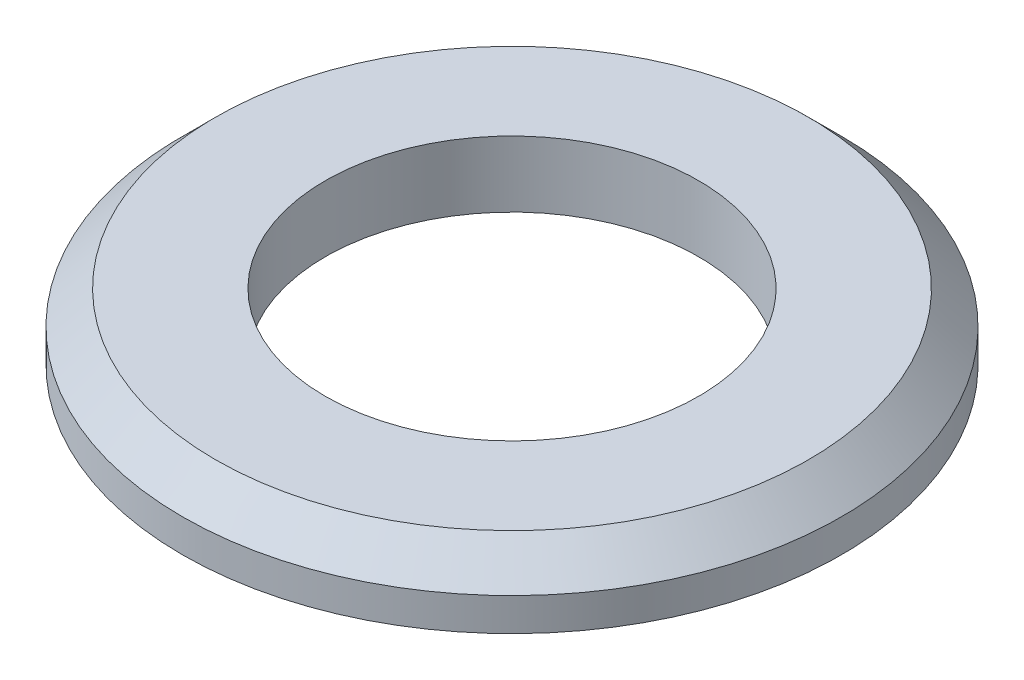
ISO-10303-21;
HEADER;
FILE_DESCRIPTION(('STEP AP214'),'2;1');
FILE_NAME('part.step','',(''),(''),'','','');
FILE_SCHEMA(('AUTOMOTIVE_DESIGN { 1 0 10303 214 1 1 1 1 }'));
ENDSEC;
DATA;
#1=APPLICATION_CONTEXT('core data for automotive mechanical design processes');
#2=APPLICATION_PROTOCOL_DEFINITION('international standard','automotive_design',2000,#1);
#3=PRODUCT_CONTEXT('',#1,'mechanical');
#4=PRODUCT('Part','Part','',(#3));
#5=PRODUCT_RELATED_PRODUCT_CATEGORY('part','',(#4));
#6=PRODUCT_DEFINITION_FORMATION('','',#4);
#7=PRODUCT_DEFINITION_CONTEXT('part definition',#1,'design');
#8=PRODUCT_DEFINITION('design','',#6,#7);
#9=PRODUCT_DEFINITION_SHAPE('','',#8);
#10=(LENGTH_UNIT() NAMED_UNIT(*) SI_UNIT(.MILLI.,.METRE.));
#11=(NAMED_UNIT(*) PLANE_ANGLE_UNIT() SI_UNIT($,.RADIAN.));
#12=(NAMED_UNIT(*) SI_UNIT($,.STERADIAN.) SOLID_ANGLE_UNIT());
#13=UNCERTAINTY_MEASURE_WITH_UNIT(LENGTH_MEASURE(1.E-05),#10,'distance_accuracy_value','');
#14=(GEOMETRIC_REPRESENTATION_CONTEXT(3) GLOBAL_UNCERTAINTY_ASSIGNED_CONTEXT((#13)) GLOBAL_UNIT_ASSIGNED_CONTEXT((#10,
#11,#12)) REPRESENTATION_CONTEXT('',''));
#15=CARTESIAN_POINT('',(0.,0.,0.));
#16=DIRECTION('',(0.,0.,1.));
#17=DIRECTION('',(1.,0.,0.));
#18=AXIS2_PLACEMENT_3D('',#15,#16,#17);
#19=CARTESIAN_POINT('',(0.,3.,0.));
#20=DIRECTION('',(0.,1.,0.));
#21=DIRECTION('',(0.,0.,1.));
#22=AXIS2_PLACEMENT_3D('',#19,#20,#21);
#23=PLANE('',#22);
#24=CARTESIAN_POINT('',(0.,3.,0.));
#25=DIRECTION('',(0.,1.,0.));
#26=DIRECTION('',(0.,0.,1.));
#27=AXIS2_PLACEMENT_3D('',#24,#25,#26);
#28=CIRCLE('',#27,13.5);
#29=CARTESIAN_POINT('',(0.,3.,13.5));
#30=VERTEX_POINT('',#29);
#31=EDGE_CURVE('E35',#30,#30,#28,.T.);
#32=ORIENTED_EDGE('',*,*,#31,.T.);
#33=EDGE_LOOP('',(#32));
#34=FACE_BOUND('',#33,.T.);
#35=CARTESIAN_POINT('',(0.,3.,0.));
#36=DIRECTION('',(0.,1.,0.));
#37=DIRECTION('',(0.,0.,1.));
#38=AXIS2_PLACEMENT_3D('',#35,#36,#37);
#39=CIRCLE('',#38,8.5);
#40=CARTESIAN_POINT('',(0.,3.,8.5));
#41=VERTEX_POINT('',#40);
#42=EDGE_CURVE('E43',#41,#41,#39,.T.);
#43=ORIENTED_EDGE('',*,*,#42,.F.);
#44=EDGE_LOOP('',(#43));
#45=FACE_BOUND('',#44,.T.);
#46=ADVANCED_FACE('F28',(#34,#45),#23,.T.);
#47=CARTESIAN_POINT('',(0.,0.,0.));
#48=DIRECTION('',(0.,1.,0.));
#49=DIRECTION('',(0.,0.,1.));
#50=AXIS2_PLACEMENT_3D('',#47,#48,#49);
#51=PLANE('',#50);
#52=CARTESIAN_POINT('',(0.,0.,0.));
#53=DIRECTION('',(0.,1.,0.));
#54=DIRECTION('',(0.,0.,1.));
#55=AXIS2_PLACEMENT_3D('',#52,#53,#54);
#56=CIRCLE('',#55,15.);
#57=CARTESIAN_POINT('',(0.,0.,15.));
#58=VERTEX_POINT('',#57);
#59=EDGE_CURVE('E39',#58,#58,#56,.T.);
#60=ORIENTED_EDGE('',*,*,#59,.F.);
#61=EDGE_LOOP('',(#60));
#62=FACE_BOUND('',#61,.T.);
#63=CARTESIAN_POINT('',(0.,0.,0.));
#64=DIRECTION('',(0.,1.,0.));
#65=DIRECTION('',(0.,0.,1.));
#66=AXIS2_PLACEMENT_3D('',#63,#64,#65);
#67=CIRCLE('',#66,8.5);
#68=CARTESIAN_POINT('',(0.,0.,8.5));
#69=VERTEX_POINT('',#68);
#70=EDGE_CURVE('E48',#69,#69,#67,.T.);
#71=ORIENTED_EDGE('',*,*,#70,.T.);
#72=EDGE_LOOP('',(#71));
#73=FACE_BOUND('',#72,.T.);
#74=ADVANCED_FACE('F52',(#62,#73),#51,.F.);
#75=CARTESIAN_POINT('',(0.,3.,0.));
#76=DIRECTION('',(0.,-1.,0.));
#77=DIRECTION('',(0.,0.,-1.));
#78=AXIS2_PLACEMENT_3D('',#75,#76,#77);
#79=CYLINDRICAL_SURFACE('',#78,15.);
#80=CARTESIAN_POINT('',(0.,1.5,0.));
#81=DIRECTION('',(0.,1.,0.));
#82=DIRECTION('',(0.,0.,1.));
#83=AXIS2_PLACEMENT_3D('',#80,#81,#82);
#84=CIRCLE('',#83,15.);
#85=CARTESIAN_POINT('',(0.,1.5,15.));
#86=VERTEX_POINT('',#85);
#87=EDGE_CURVE('E10',#86,#86,#84,.F.);
#88=ORIENTED_EDGE('',*,*,#87,.T.);
#89=EDGE_LOOP('',(#88));
#90=FACE_BOUND('',#89,.T.);
#91=ORIENTED_EDGE('',*,*,#59,.T.);
#92=EDGE_LOOP('',(#91));
#93=FACE_BOUND('',#92,.T.);
#94=ADVANCED_FACE('F30',(#90,#93),#79,.T.);
#95=CARTESIAN_POINT('',(0.,3.,0.));
#96=DIRECTION('',(0.,-1.,0.));
#97=DIRECTION('',(0.,0.,-1.));
#98=AXIS2_PLACEMENT_3D('',#95,#96,#97);
#99=CYLINDRICAL_SURFACE('',#98,8.5);
#100=ORIENTED_EDGE('',*,*,#42,.T.);
#101=EDGE_LOOP('',(#100));
#102=FACE_BOUND('',#101,.T.);
#103=ORIENTED_EDGE('',*,*,#70,.F.);
#104=EDGE_LOOP('',(#103));
#105=FACE_BOUND('',#104,.T.);
#106=ADVANCED_FACE('F54',(#102,#105),#99,.F.);
#107=CARTESIAN_POINT('',(0.,3.,0.));
#108=DIRECTION('',(0.,-1.,0.));
#109=DIRECTION('',(0.,0.,-1.));
#110=AXIS2_PLACEMENT_3D('',#107,#108,#109);
#111=CONICAL_SURFACE('',#110,13.5,0.785398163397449);
#112=ORIENTED_EDGE('',*,*,#87,.F.);
#113=EDGE_LOOP('',(#112));
#114=FACE_BOUND('',#113,.T.);
#115=ORIENTED_EDGE('',*,*,#31,.F.);
#116=EDGE_LOOP('',(#115));
#117=FACE_BOUND('',#116,.T.);
#118=ADVANCED_FACE('F56',(#114,#117),#111,.T.);
#119=CLOSED_SHELL('',(#46,#74,#94,#106,#118));
#120=MANIFOLD_SOLID_BREP('B2',#119);
#121=ADVANCED_BREP_SHAPE_REPRESENTATION('',(#18,#120),#14);
#122=SHAPE_DEFINITION_REPRESENTATION(#9,#121);
ENDSEC;
END-ISO-10303-21;
